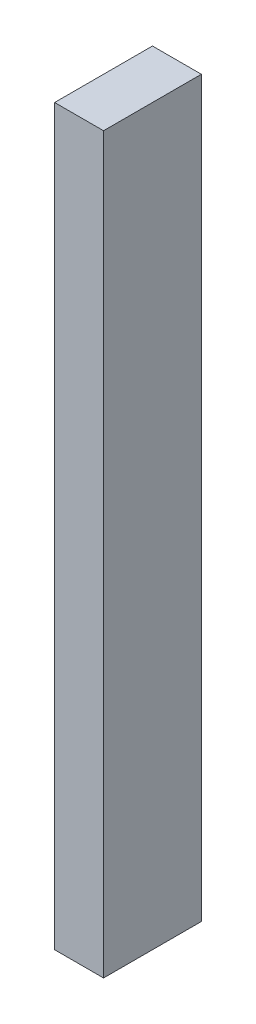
from build123d import *

# Parameters (mm, degrees)
SKETCH1_W          = 10
SKETCH1_H          = 150
BASE_EXTRUDE_DEPTH = 10


with BuildPart() as part:
    # Sketch1 → Base-Extrude (new, symmetric)
    with BuildSketch(Plane.XY):
        with Locations((5, 75)):
            Rectangle(SKETCH1_W, SKETCH1_H)
    extrude(amount=BASE_EXTRUDE_DEPTH, both=True)


solid = part.part
